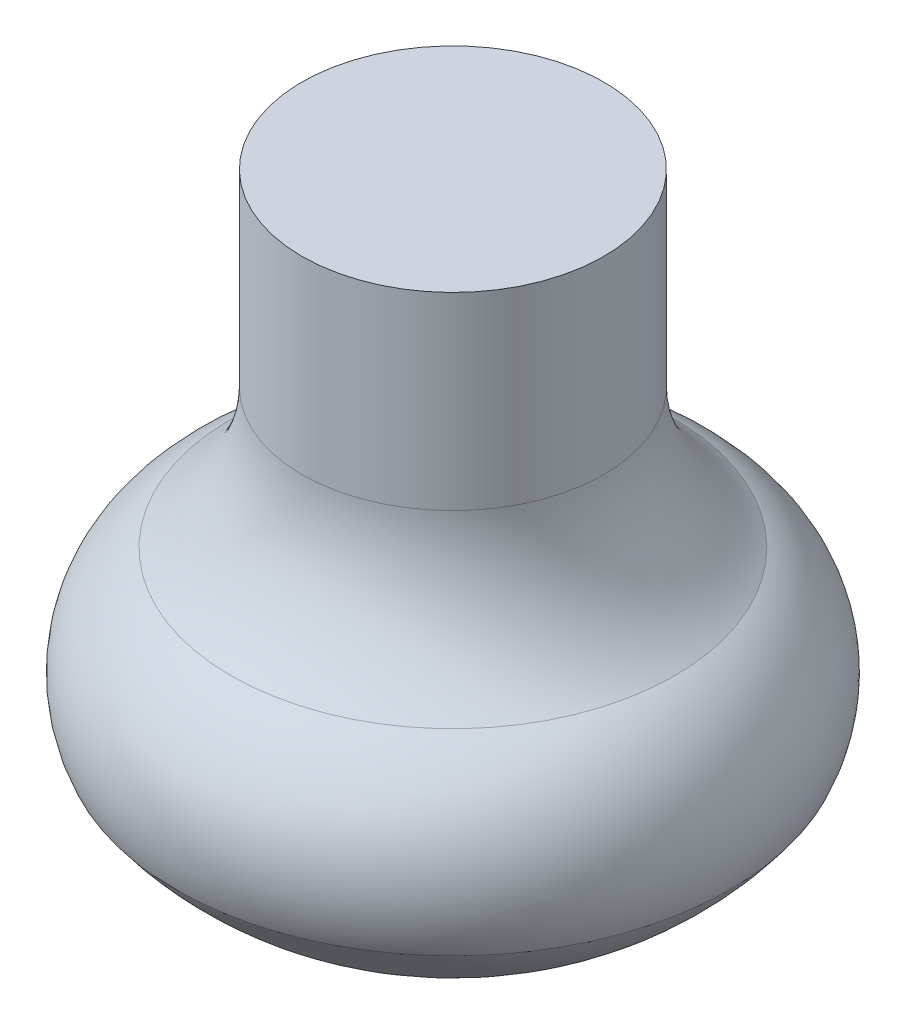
ISO-10303-21;
HEADER;
FILE_DESCRIPTION(('STEP AP214'),'2;1');
FILE_NAME('part.step','',(''),(''),'','','');
FILE_SCHEMA(('AUTOMOTIVE_DESIGN { 1 0 10303 214 1 1 1 1 }'));
ENDSEC;
DATA;
#1=APPLICATION_CONTEXT('core data for automotive mechanical design processes');
#2=APPLICATION_PROTOCOL_DEFINITION('international standard','automotive_design',2000,#1);
#3=PRODUCT_CONTEXT('',#1,'mechanical');
#4=PRODUCT('Part','Part','',(#3));
#5=PRODUCT_RELATED_PRODUCT_CATEGORY('part','',(#4));
#6=PRODUCT_DEFINITION_FORMATION('','',#4);
#7=PRODUCT_DEFINITION_CONTEXT('part definition',#1,'design');
#8=PRODUCT_DEFINITION('design','',#6,#7);
#9=PRODUCT_DEFINITION_SHAPE('','',#8);
#10=(LENGTH_UNIT() NAMED_UNIT(*) SI_UNIT(.MILLI.,.METRE.));
#11=(NAMED_UNIT(*) PLANE_ANGLE_UNIT() SI_UNIT($,.RADIAN.));
#12=(NAMED_UNIT(*) SI_UNIT($,.STERADIAN.) SOLID_ANGLE_UNIT());
#13=UNCERTAINTY_MEASURE_WITH_UNIT(LENGTH_MEASURE(1.E-05),#10,'distance_accuracy_value','');
#14=(GEOMETRIC_REPRESENTATION_CONTEXT(3) GLOBAL_UNCERTAINTY_ASSIGNED_CONTEXT((#13)) GLOBAL_UNIT_ASSIGNED_CONTEXT((#10,
#11,#12)) REPRESENTATION_CONTEXT('',''));
#15=CARTESIAN_POINT('',(0.,0.,0.));
#16=DIRECTION('',(0.,0.,1.));
#17=DIRECTION('',(1.,0.,0.));
#18=AXIS2_PLACEMENT_3D('',#15,#16,#17);
#19=CARTESIAN_POINT('',(0.,28.8093093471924,3.93813039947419));
#20=DIRECTION('',(-1.,0.,0.));
#21=DIRECTION('',(0.,0.,1.));
#22=AXIS2_PLACEMENT_3D('',#19,#20,#21);
#23=CIRCLE('',#22,29.0772277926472);
#24=TRIMMED_CURVE('',#23,(PARAMETER_VALUE(-1.70665076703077)),
(PARAMETER_VALUE(1.70665076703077)),.T.,.PARAMETER.);
#25=CARTESIAN_POINT('',(0.,28.8093093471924,0.));
#26=DIRECTION('',(0.,1.,0.));
#27=AXIS1_PLACEMENT('',#25,#26);
#28=SURFACE_OF_REVOLUTION('',#24,#27);
#29=CARTESIAN_POINT('',(0.,11.7704280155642,0.));
#30=DIRECTION('',(0.,1.,0.));
#31=DIRECTION('',(0.,0.,1.));
#32=AXIS2_PLACEMENT_3D('',#29,#30,#31);
#33=CIRCLE('',#32,27.5);
#34=CARTESIAN_POINT('',(0.,11.7704280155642,27.5));
#35=VERTEX_POINT('',#34);
#36=EDGE_CURVE('E11',#35,#35,#33,.T.);
#37=ORIENTED_EDGE('',*,*,#36,.F.);
#38=EDGE_LOOP('',(#37));
#39=FACE_BOUND('',#38,.T.);
#40=CARTESIAN_POINT('',(0.,0.,0.));
#41=VERTEX_POINT('',#40);
#42=VERTEX_LOOP('',#41);
#43=FACE_BOUND('',#42,.T.);
#44=ADVANCED_FACE('F41',(#39,#43),#28,.T.);
#45=CARTESIAN_POINT('',(0.,16.736065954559,0.));
#46=DIRECTION('',(0.,1.,0.));
#47=DIRECTION('',(0.,0.,1.));
#48=AXIS2_PLACEMENT_3D('',#45,#46,#47);
#49=TOROIDAL_SURFACE('',#48,16.4940254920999,12.0743130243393);
#50=CARTESIAN_POINT('',(0.,27.4539974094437,0.));
#51=DIRECTION('',(0.,1.,0.));
#52=DIRECTION('',(0.,0.,1.));
#53=AXIS2_PLACEMENT_3D('',#50,#51,#52);
#54=CIRCLE('',#53,22.0541496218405);
#55=CARTESIAN_POINT('',(0.,27.4539974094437,22.0541496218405));
#56=VERTEX_POINT('',#55);
#57=EDGE_CURVE('E48',#56,#56,#54,.T.);
#58=ORIENTED_EDGE('',*,*,#57,.F.);
#59=EDGE_LOOP('',(#58));
#60=FACE_BOUND('',#59,.T.);
#61=ORIENTED_EDGE('',*,*,#36,.T.);
#62=EDGE_LOOP('',(#61));
#63=FACE_BOUND('',#62,.T.);
#64=ADVANCED_FACE('F52',(#60,#63),#49,.T.);
#65=CARTESIAN_POINT('',(0.,41.2271391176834,0.));
#66=DIRECTION('',(0.,1.,0.));
#67=DIRECTION('',(0.,0.,1.));
#68=AXIS2_PLACEMENT_3D('',#65,#66,#67);
#69=TOROIDAL_SURFACE('',#68,31.9730210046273,16.9730210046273);
#70=CARTESIAN_POINT('',(0.,41.2271391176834,0.));
#71=DIRECTION('',(0.,1.,0.));
#72=DIRECTION('',(0.,0.,1.));
#73=AXIS2_PLACEMENT_3D('',#70,#71,#72);
#74=CIRCLE('',#73,15.);
#75=CARTESIAN_POINT('',(0.,41.2271391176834,15.));
#76=VERTEX_POINT('',#75);
#77=EDGE_CURVE('E81',#76,#76,#74,.T.);
#78=ORIENTED_EDGE('',*,*,#77,.F.);
#79=EDGE_LOOP('',(#78));
#80=FACE_BOUND('',#79,.T.);
#81=ORIENTED_EDGE('',*,*,#57,.T.);
#82=EDGE_LOOP('',(#81));
#83=FACE_BOUND('',#82,.T.);
#84=ADVANCED_FACE('F57',(#80,#83),#69,.F.);
#85=CARTESIAN_POINT('',(0.,60.,0.));
#86=DIRECTION('',(0.,1.,0.));
#87=DIRECTION('',(0.,0.,1.));
#88=AXIS2_PLACEMENT_3D('',#85,#86,#87);
#89=CYLINDRICAL_SURFACE('',#88,15.);
#90=CARTESIAN_POINT('',(0.,60.,0.));
#91=DIRECTION('',(0.,1.,0.));
#92=DIRECTION('',(0.,0.,1.));
#93=AXIS2_PLACEMENT_3D('',#90,#91,#92);
#94=CIRCLE('',#93,15.);
#95=CARTESIAN_POINT('',(0.,60.,15.));
#96=VERTEX_POINT('',#95);
#97=EDGE_CURVE('E79',#96,#96,#94,.T.);
#98=ORIENTED_EDGE('',*,*,#97,.F.);
#99=EDGE_LOOP('',(#98));
#100=FACE_BOUND('',#99,.T.);
#101=ORIENTED_EDGE('',*,*,#77,.T.);
#102=EDGE_LOOP('',(#101));
#103=FACE_BOUND('',#102,.T.);
#104=ADVANCED_FACE('F64',(#100,#103),#89,.T.);
#105=CARTESIAN_POINT('',(15.,60.,0.));
#106=DIRECTION('',(0.,-1.,0.));
#107=DIRECTION('',(0.,0.,-1.));
#108=AXIS2_PLACEMENT_3D('',#105,#106,#107);
#109=PLANE('',#108);
#110=ORIENTED_EDGE('',*,*,#97,.T.);
#111=EDGE_LOOP('',(#110));
#112=FACE_BOUND('',#111,.T.);
#113=ADVANCED_FACE('F71',(#112),#109,.F.);
#114=CLOSED_SHELL('',(#44,#64,#84,#104,#113));
#115=MANIFOLD_SOLID_BREP('B2',#114);
#116=ADVANCED_BREP_SHAPE_REPRESENTATION('',(#18,#115),#14);
#117=SHAPE_DEFINITION_REPRESENTATION(#9,#116);
ENDSEC;
END-ISO-10303-21;
